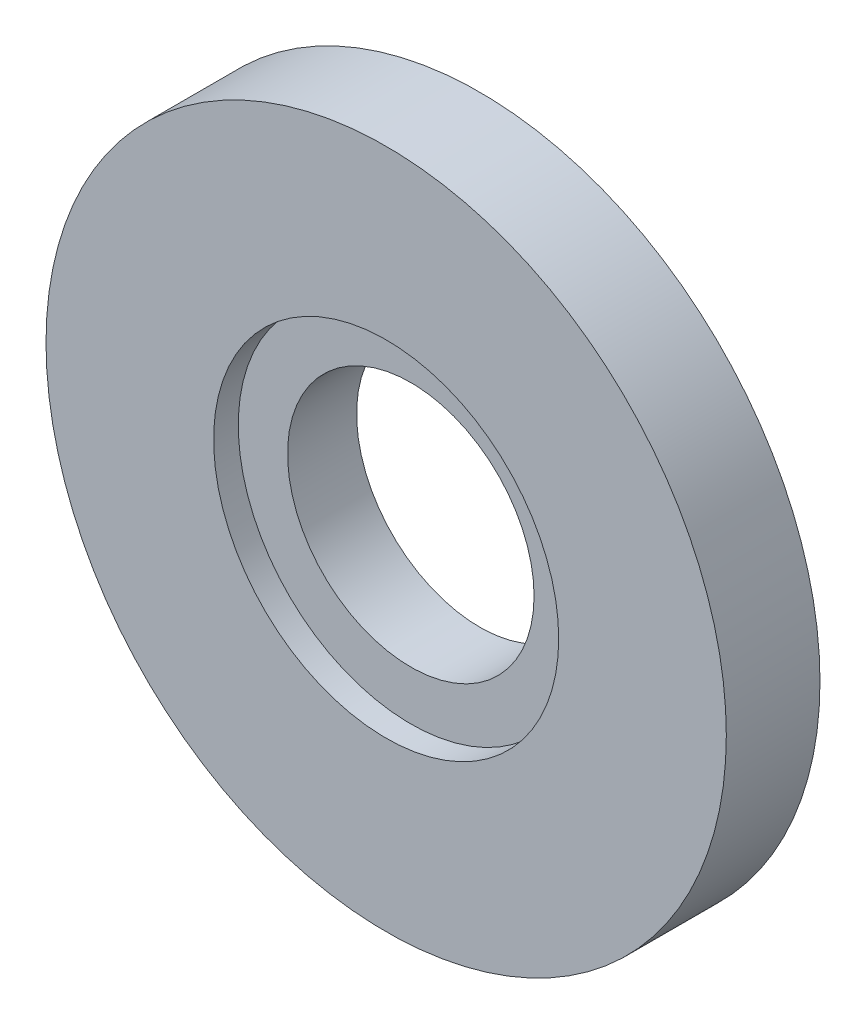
from build123d import *

# Parameters (mm, degrees)
SKETCH1_R           = 8.763
SKETCH1_R_2         = 3.175
WASHER_DEPTH        = 2.413
SKETCH2_R           = 4.445
FLANGE_RECESS_DEPTH = 0.635


with BuildPart() as part:
    # Sketch1 → washer (new body)
    with BuildSketch(Plane.XY):
        Circle(SKETCH1_R)
        Circle(SKETCH1_R_2, mode=Mode.SUBTRACT)
    extrude(amount=WASHER_DEPTH)

    # Sketch2 → flange_recess (cut)
    with BuildSketch(Plane.XY.offset(2.413)):
        Circle(SKETCH2_R)
    extrude(amount=-FLANGE_RECESS_DEPTH, mode=Mode.SUBTRACT)


solid = part.part
